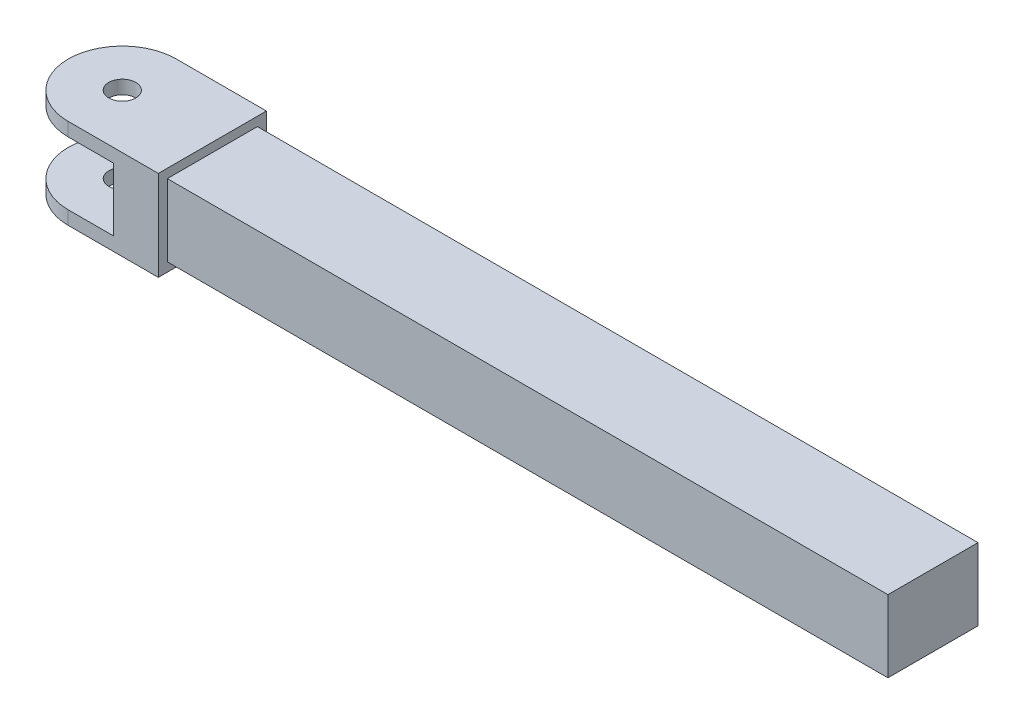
from build123d import *

# Parameters (mm, degrees)
SZKIC1_R                    = 1.5
DODANIE_WYCI_GNI_CIE1_DEPTH = 10
SZKIC2_W                    = 22
SZKIC2_H                    = 7
WYTNIJ_WYCI_GNI_CIE1_DEPTH  = 92.345497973
SZKIC3_OUTSIDE_W            = 33.452
SZKIC3_OUTSIDE_H            = 31.452
SZKIC3_OUTSIDE_W_2          = 10
SZKIC3_OUTSIDE_H_2          = 8
WYTNIJ_WYCI_GNI_CIE2_DEPTH  = 80


with BuildPart() as part:
    # Szkic1 → Dodanie-wyci_gni_cie1 (new body)
    with BuildSketch(Plane(origin=(0, 0, 0), x_dir=(1, 0, 0), z_dir=(0, 1, 0))):
        with BuildLine():
            Line((90, 6), (90, -6))
            Line((90, -6), (0, -6))
            ThreePointArc((0, -6), (-6, 0), (0, 6))
            Line((0, 6), (90, 6))
        make_face()
        with Locations(Location((0, 0, 0), (0, 0, 270))):
            Circle(SZKIC1_R, mode=Mode.SUBTRACT)
    extrude(amount=DODANIE_WYCI_GNI_CIE1_DEPTH)

    # Szkic2 → Wytnij-wyci_gni_cie1 (cut, through all)
    with BuildSketch(Plane(origin=(0, 0, -6), x_dir=(-1, 0, 0), z_dir=(0, 0, -1))):
        with Locations((6, 5)):
            Rectangle(SZKIC2_W, SZKIC2_H)
    extrude(amount=-WYTNIJ_WYCI_GNI_CIE1_DEPTH, mode=Mode.SUBTRACT)

    # Szkic3 outside → Wytnij-wyci_gni_cie2 (cut)
    with BuildSketch(Plane(origin=(90, 0, 0), x_dir=(0, 0, -1), z_dir=(1, 0, 0))):
        with Locations((0, 5)):
            Rectangle(SZKIC3_OUTSIDE_W, SZKIC3_OUTSIDE_H)
        with Locations((0, 5)):
            Rectangle(SZKIC3_OUTSIDE_W_2, SZKIC3_OUTSIDE_H_2, mode=Mode.SUBTRACT)
    extrude(amount=-WYTNIJ_WYCI_GNI_CIE2_DEPTH, mode=Mode.SUBTRACT)


solid = part.part
